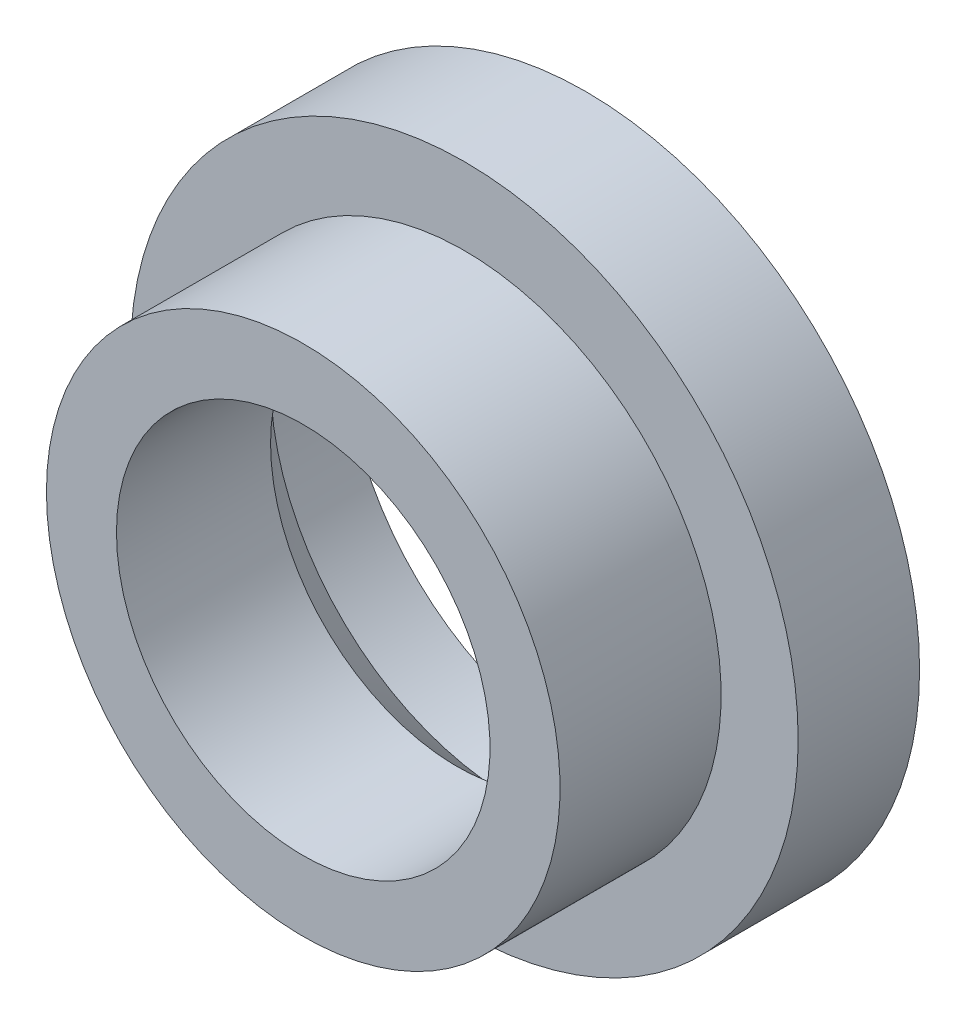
ISO-10303-21;
HEADER;
FILE_DESCRIPTION(('STEP AP214'),'2;1');
FILE_NAME('part.step','',(''),(''),'','','');
FILE_SCHEMA(('AUTOMOTIVE_DESIGN { 1 0 10303 214 1 1 1 1 }'));
ENDSEC;
DATA;
#1=APPLICATION_CONTEXT('core data for automotive mechanical design processes');
#2=APPLICATION_PROTOCOL_DEFINITION('international standard','automotive_design',2000,#1);
#3=PRODUCT_CONTEXT('',#1,'mechanical');
#4=PRODUCT('Part','Part','',(#3));
#5=PRODUCT_RELATED_PRODUCT_CATEGORY('part','',(#4));
#6=PRODUCT_DEFINITION_FORMATION('','',#4);
#7=PRODUCT_DEFINITION_CONTEXT('part definition',#1,'design');
#8=PRODUCT_DEFINITION('design','',#6,#7);
#9=PRODUCT_DEFINITION_SHAPE('','',#8);
#10=(LENGTH_UNIT() NAMED_UNIT(*) SI_UNIT(.MILLI.,.METRE.));
#11=(NAMED_UNIT(*) PLANE_ANGLE_UNIT() SI_UNIT($,.RADIAN.));
#12=(NAMED_UNIT(*) SI_UNIT($,.STERADIAN.) SOLID_ANGLE_UNIT());
#13=UNCERTAINTY_MEASURE_WITH_UNIT(LENGTH_MEASURE(1.E-05),#10,'distance_accuracy_value','');
#14=(GEOMETRIC_REPRESENTATION_CONTEXT(3) GLOBAL_UNCERTAINTY_ASSIGNED_CONTEXT((#13)) GLOBAL_UNIT_ASSIGNED_CONTEXT((#10,
#11,#12)) REPRESENTATION_CONTEXT('',''));
#15=CARTESIAN_POINT('',(0.,0.,0.));
#16=DIRECTION('',(0.,0.,1.));
#17=DIRECTION('',(1.,0.,0.));
#18=AXIS2_PLACEMENT_3D('',#15,#16,#17);
#19=CARTESIAN_POINT('',(0.,0.,0.));
#20=DIRECTION('',(0.,0.,-1.));
#21=DIRECTION('',(-1.,0.,0.));
#22=AXIS2_PLACEMENT_3D('',#19,#20,#21);
#23=CYLINDRICAL_SURFACE('',#22,14.3);
#24=CARTESIAN_POINT('',(0.,0.,5.2));
#25=DIRECTION('',(0.,0.,-1.));
#26=DIRECTION('',(-1.,0.,0.));
#27=AXIS2_PLACEMENT_3D('',#24,#25,#26);
#28=CIRCLE('',#27,14.3);
#29=CARTESIAN_POINT('',(-14.3,0.,5.2));
#30=VERTEX_POINT('',#29);
#31=EDGE_CURVE('E8',#30,#30,#28,.T.);
#32=ORIENTED_EDGE('',*,*,#31,.T.);
#33=EDGE_LOOP('',(#32));
#34=FACE_BOUND('',#33,.T.);
#35=CARTESIAN_POINT('',(0.,0.,0.));
#36=DIRECTION('',(0.,0.,-1.));
#37=DIRECTION('',(-1.,0.,0.));
#38=AXIS2_PLACEMENT_3D('',#35,#36,#37);
#39=CIRCLE('',#38,14.3);
#40=CARTESIAN_POINT('',(-14.3,0.,0.));
#41=VERTEX_POINT('',#40);
#42=EDGE_CURVE('E40',#41,#41,#39,.T.);
#43=ORIENTED_EDGE('',*,*,#42,.F.);
#44=EDGE_LOOP('',(#43));
#45=FACE_BOUND('',#44,.T.);
#46=ADVANCED_FACE('F12',(#34,#45),#23,.T.);
#47=CARTESIAN_POINT('',(0.,14.3,5.2));
#48=DIRECTION('',(0.,0.,1.));
#49=DIRECTION('',(1.,0.,0.));
#50=AXIS2_PLACEMENT_3D('',#47,#48,#49);
#51=PLANE('',#50);
#52=CARTESIAN_POINT('',(0.,0.,5.2));
#53=DIRECTION('',(0.,0.,-1.));
#54=DIRECTION('',(-1.,0.,0.));
#55=AXIS2_PLACEMENT_3D('',#52,#53,#54);
#56=CIRCLE('',#55,11.);
#57=CARTESIAN_POINT('',(-11.,0.,5.2));
#58=VERTEX_POINT('',#57);
#59=EDGE_CURVE('E18',#58,#58,#56,.T.);
#60=ORIENTED_EDGE('',*,*,#59,.T.);
#61=EDGE_LOOP('',(#60));
#62=FACE_BOUND('',#61,.T.);
#63=ORIENTED_EDGE('',*,*,#31,.F.);
#64=EDGE_LOOP('',(#63));
#65=FACE_BOUND('',#64,.T.);
#66=ADVANCED_FACE('F48',(#62,#65),#51,.T.);
#67=CARTESIAN_POINT('',(0.,0.,0.));
#68=DIRECTION('',(0.,0.,-1.));
#69=DIRECTION('',(-1.,0.,0.));
#70=AXIS2_PLACEMENT_3D('',#67,#68,#69);
#71=CYLINDRICAL_SURFACE('',#70,11.);
#72=CARTESIAN_POINT('',(0.,0.,12.1));
#73=DIRECTION('',(0.,0.,-1.));
#74=DIRECTION('',(-1.,0.,0.));
#75=AXIS2_PLACEMENT_3D('',#72,#73,#74);
#76=CIRCLE('',#75,11.);
#77=CARTESIAN_POINT('',(-11.,0.,12.1));
#78=VERTEX_POINT('',#77);
#79=EDGE_CURVE('E22',#78,#78,#76,.T.);
#80=ORIENTED_EDGE('',*,*,#79,.T.);
#81=EDGE_LOOP('',(#80));
#82=FACE_BOUND('',#81,.T.);
#83=ORIENTED_EDGE('',*,*,#59,.F.);
#84=EDGE_LOOP('',(#83));
#85=FACE_BOUND('',#84,.T.);
#86=ADVANCED_FACE('F53',(#82,#85),#71,.T.);
#87=CARTESIAN_POINT('',(0.,11.,12.1));
#88=DIRECTION('',(0.,0.,1.));
#89=DIRECTION('',(1.,0.,0.));
#90=AXIS2_PLACEMENT_3D('',#87,#88,#89);
#91=PLANE('',#90);
#92=CARTESIAN_POINT('',(0.,0.,12.1));
#93=DIRECTION('',(0.,0.,-1.));
#94=DIRECTION('',(-1.,0.,0.));
#95=AXIS2_PLACEMENT_3D('',#92,#93,#94);
#96=CIRCLE('',#95,8.);
#97=CARTESIAN_POINT('',(-8.,0.,12.1));
#98=VERTEX_POINT('',#97);
#99=EDGE_CURVE('E26',#98,#98,#96,.T.);
#100=ORIENTED_EDGE('',*,*,#99,.T.);
#101=EDGE_LOOP('',(#100));
#102=FACE_BOUND('',#101,.T.);
#103=ORIENTED_EDGE('',*,*,#79,.F.);
#104=EDGE_LOOP('',(#103));
#105=FACE_BOUND('',#104,.T.);
#106=ADVANCED_FACE('F57',(#102,#105),#91,.T.);
#107=CARTESIAN_POINT('',(0.,0.,0.));
#108=DIRECTION('',(0.,0.,-1.));
#109=DIRECTION('',(-1.,0.,0.));
#110=AXIS2_PLACEMENT_3D('',#107,#108,#109);
#111=CYLINDRICAL_SURFACE('',#110,8.);
#112=CARTESIAN_POINT('',(0.,0.,5.5));
#113=DIRECTION('',(0.,0.,-1.));
#114=DIRECTION('',(-1.,0.,0.));
#115=AXIS2_PLACEMENT_3D('',#112,#113,#114);
#116=CIRCLE('',#115,8.);
#117=CARTESIAN_POINT('',(-8.,0.,5.5));
#118=VERTEX_POINT('',#117);
#119=EDGE_CURVE('E31',#118,#118,#116,.T.);
#120=ORIENTED_EDGE('',*,*,#119,.T.);
#121=EDGE_LOOP('',(#120));
#122=FACE_BOUND('',#121,.T.);
#123=ORIENTED_EDGE('',*,*,#99,.F.);
#124=EDGE_LOOP('',(#123));
#125=FACE_BOUND('',#124,.T.);
#126=ADVANCED_FACE('F64',(#122,#125),#111,.F.);
#127=CARTESIAN_POINT('',(0.,0.,5.5));
#128=DIRECTION('',(0.,0.,-1.));
#129=DIRECTION('',(-1.,0.,0.));
#130=AXIS2_PLACEMENT_3D('',#127,#128,#129);
#131=CONICAL_SURFACE('',#130,8.,0.785398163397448);
#132=CARTESIAN_POINT('',(0.,0.,3.15));
#133=DIRECTION('',(0.,0.,-1.));
#134=DIRECTION('',(-1.,0.,0.));
#135=AXIS2_PLACEMENT_3D('',#132,#133,#134);
#136=CIRCLE('',#135,10.35);
#137=CARTESIAN_POINT('',(-10.35,0.,3.15));
#138=VERTEX_POINT('',#137);
#139=EDGE_CURVE('E34',#138,#138,#136,.T.);
#140=ORIENTED_EDGE('',*,*,#139,.T.);
#141=EDGE_LOOP('',(#140));
#142=FACE_BOUND('',#141,.T.);
#143=ORIENTED_EDGE('',*,*,#119,.F.);
#144=EDGE_LOOP('',(#143));
#145=FACE_BOUND('',#144,.T.);
#146=ADVANCED_FACE('F68',(#142,#145),#131,.F.);
#147=CARTESIAN_POINT('',(0.,0.,0.));
#148=DIRECTION('',(0.,0.,-1.));
#149=DIRECTION('',(-1.,0.,0.));
#150=AXIS2_PLACEMENT_3D('',#147,#148,#149);
#151=CYLINDRICAL_SURFACE('',#150,10.35);
#152=CARTESIAN_POINT('',(0.,0.,0.));
#153=DIRECTION('',(0.,0.,-1.));
#154=DIRECTION('',(-1.,0.,0.));
#155=AXIS2_PLACEMENT_3D('',#152,#153,#154);
#156=CIRCLE('',#155,10.35);
#157=CARTESIAN_POINT('',(-10.35,0.,0.));
#158=VERTEX_POINT('',#157);
#159=EDGE_CURVE('E37',#158,#158,#156,.T.);
#160=ORIENTED_EDGE('',*,*,#159,.T.);
#161=EDGE_LOOP('',(#160));
#162=FACE_BOUND('',#161,.T.);
#163=ORIENTED_EDGE('',*,*,#139,.F.);
#164=EDGE_LOOP('',(#163));
#165=FACE_BOUND('',#164,.T.);
#166=ADVANCED_FACE('F72',(#162,#165),#151,.F.);
#167=CARTESIAN_POINT('',(0.,10.35,0.));
#168=DIRECTION('',(0.,0.,-1.));
#169=DIRECTION('',(-1.,0.,0.));
#170=AXIS2_PLACEMENT_3D('',#167,#168,#169);
#171=PLANE('',#170);
#172=ORIENTED_EDGE('',*,*,#42,.T.);
#173=EDGE_LOOP('',(#172));
#174=FACE_BOUND('',#173,.T.);
#175=ORIENTED_EDGE('',*,*,#159,.F.);
#176=EDGE_LOOP('',(#175));
#177=FACE_BOUND('',#176,.T.);
#178=ADVANCED_FACE('F44',(#174,#177),#171,.T.);
#179=CLOSED_SHELL('',(#46,#66,#86,#106,#126,#146,#166,#178));
#180=MANIFOLD_SOLID_BREP('B1',#179);
#181=ADVANCED_BREP_SHAPE_REPRESENTATION('',(#18,#180),#14);
#182=SHAPE_DEFINITION_REPRESENTATION(#9,#181);
ENDSEC;
END-ISO-10303-21;
